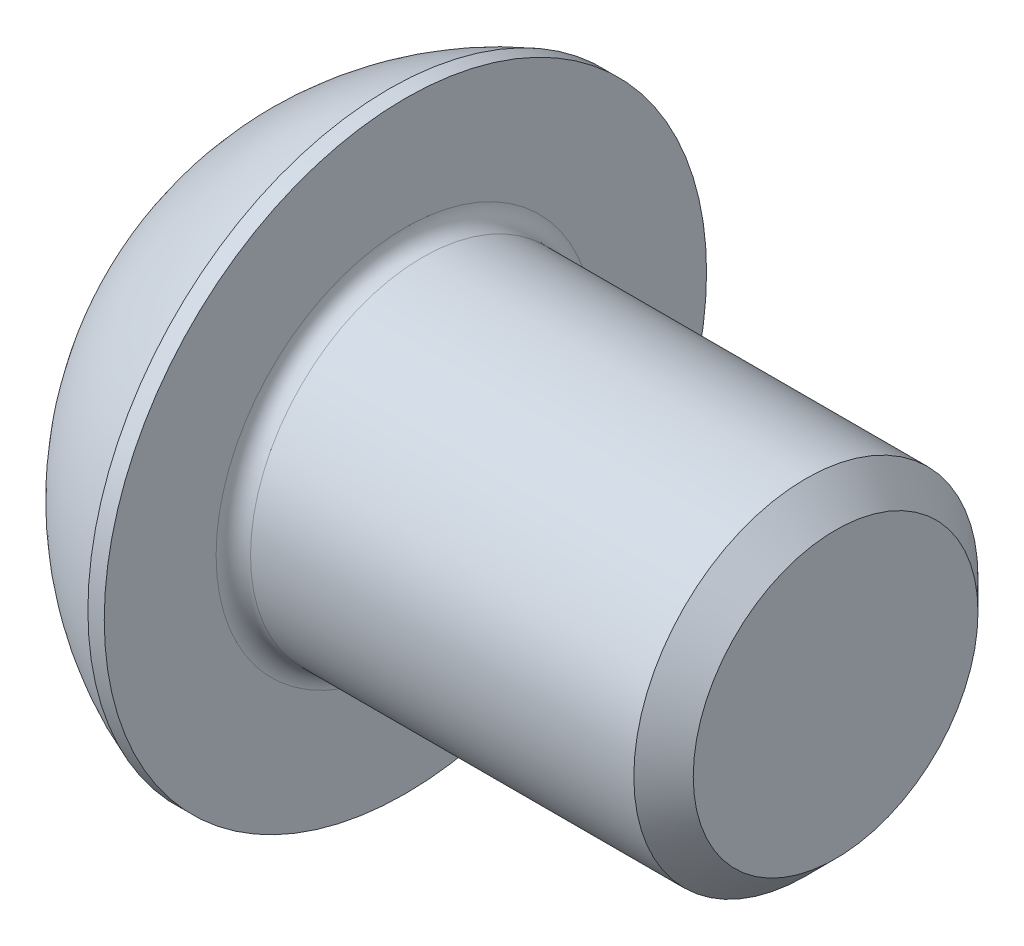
from build123d import *

# Parameters (mm, degrees)
FILLET1_R   = 0.4
HEX_2_DEPTH = 2.6


with BuildPart() as part:
    # BodySke → BaseBody (revolve)
    with BuildSketch(Plane.XY, mode=Mode.PRIVATE) as basebody_sk:
        with BuildLine():
            Line((14.4, 0), (14.4, 3.3095))
            Line((14.4, 3.3095), (13.7095, 4))
            Line((13.7095, 4), (4.4, 4))
            Line((4.4, 4), (4.4, 7))
            Line((4.4, 7), (4.02, 7))
            ThreePointArc((4.02, 7), (1.686451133, 5.621618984), (0, 3.5))
            Line((0, 3.5), (0, 0))
            Line((0, 0), (14.4, 0))
        make_face()
    revolve(basebody_sk.sketch.rotate(Axis((0, 0, 0), (1, 0, 0)), 90), axis=Axis((0, 0, 0), (1, 0, 0)))

    # Fillet1
    fillet1_edges = [part.edges().sort_by_distance(p)[0] for p in [
        (4.4, 0, -4),
    ]]
    fillet(fillet1_edges, radius=FILLET1_R)

    # Sketch2 → PreBroach (revolve, cut)
    with BuildSketch(Plane.XY, mode=Mode.PRIVATE) as prebroach_sk:
        Polygon((0, 2.5), (2.6, 2.5), (4.043375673, 0), (0, 0), align=None)
    revolve(prebroach_sk.sketch.rotate(Axis((0, 0, 0), (1, 0, 0)), 90), axis=Axis((0, 0, 0), (1, 0, 0)), mode=Mode.SUBTRACT)

    # Sketch3 → Hex 2 (cut)
    with BuildSketch(Plane(origin=(0, 0, 0), x_dir=(0, 0, -1), z_dir=(1, 0, 0))):
        Polygon((-2.5, -1.443375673), (-2.5, 1.443375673), (0, 2.886751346), (2.5, 1.443375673), (2.5, -1.443375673), (0, -2.886751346), align=None)
    extrude(amount=HEX_2_DEPTH, mode=Mode.SUBTRACT)


solid = part.part
